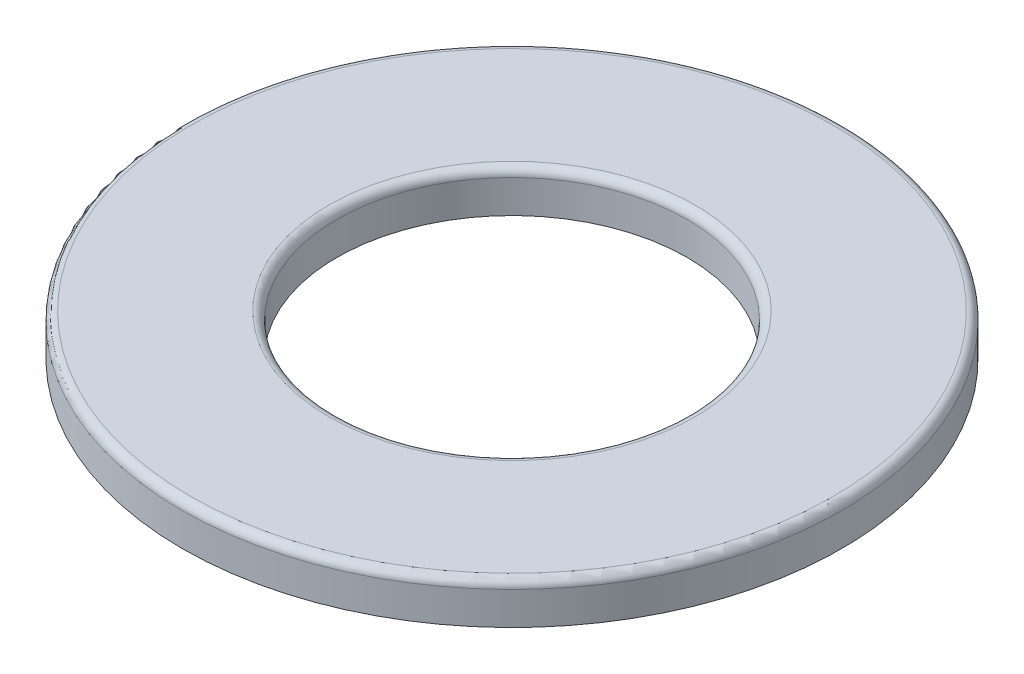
from build123d import *

# Parameters (mm, degrees)
SKETCH_1_R      = 8
SKETCH_1_R_2    = 4.25
EXTRUDE_1_DEPTH = 0.5
FILLET_1_R      = 0.2


with BuildPart() as part:
    # Sketch 1 → Extrude 1 (new, symmetric)
    with BuildSketch(Plane(origin=(0, 0, 0), x_dir=(1, 0, 0), z_dir=(0, 1, 0))):
        with Locations(Location((0, 0, 0), (0, 0, 270))):
            Circle(SKETCH_1_R)
        with Locations(Location((0, 0, 0), (0, 0, 270))):
            Circle(SKETCH_1_R_2, mode=Mode.SUBTRACT)
    extrude(amount=EXTRUDE_1_DEPTH, both=True)

    # Fillet 1
    fillet_1_edges = [part.edges().sort_by_distance(p)[0] for p in [
        (0, 0.5, -8),
        (0, 0.5, -4.25),
    ]]
    fillet(fillet_1_edges, radius=FILLET_1_R)


solid = part.part
